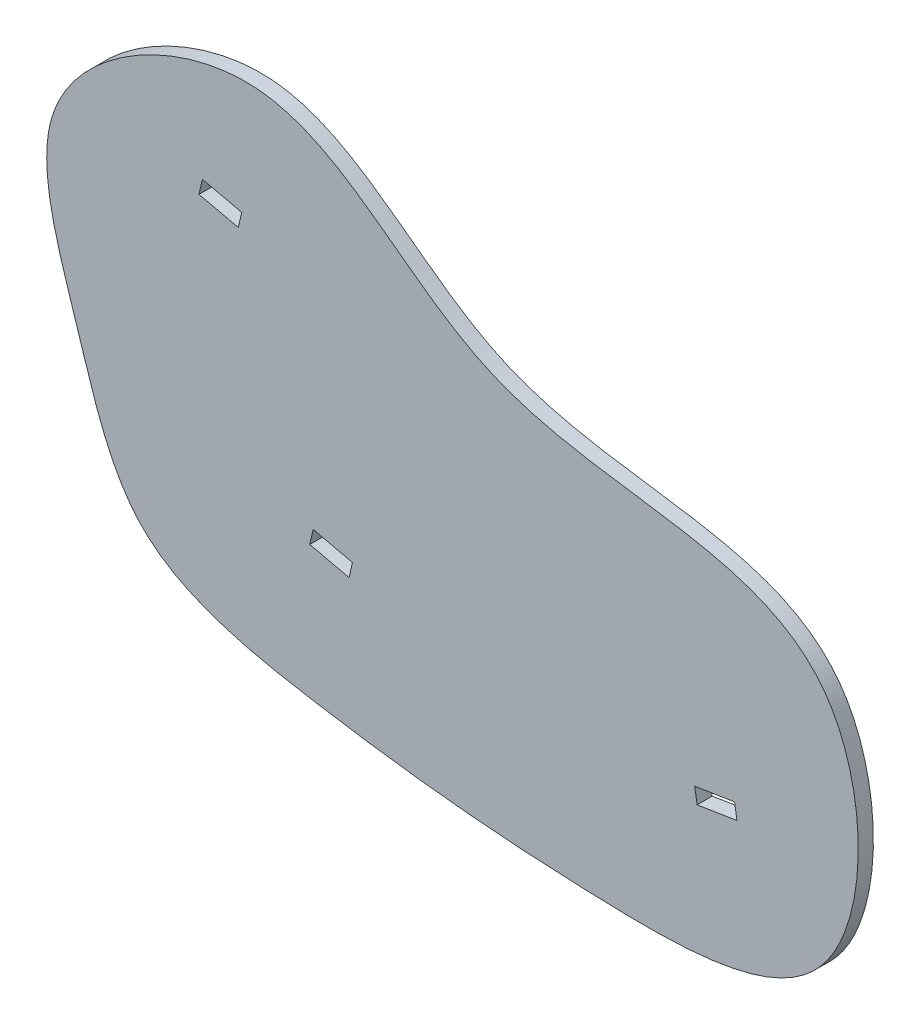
from build123d import *

# Parameters (mm, degrees)
BOSS_EXTRU_1_DEPTH      = 3
ENL_V_MAT_EXTRU_1_DEPTH = 10


with BuildPart() as part:
    # Esquisse1 → Boss.-Extru.1 (new body)
    with BuildSketch(Plane.XY):
        with BuildLine():
            add(Edge.make_bspline(
                [(-18.864168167, 58.934577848), (-34.265243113, 59.970351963), (-68.728278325, 40.47988391), (-54.053292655, 1.331674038), (-44.653372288, -33.433048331), (1.658070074, -42.880903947), (42.297327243, -46.844151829), (102.968426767, -46.433520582), (102.740932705, 33.63067355), (26.461888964, 18.734725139), (-1.47242723, 57.764924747), (-18.864168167, 58.934577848)],
                knots=[0, 0, 0, 0, 0.110992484, 0.194396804, 0.268191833, 0.351801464, 0.49083549, 0.595467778, 0.706739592, 0.874661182, 1, 1, 1, 1], degree=3))
        make_face()
    extrude(amount=BOSS_EXTRU_1_DEPTH)

    # Esquisse3 → Enl_v. mat.-Extru.1 (cut)
    with BuildSketch(Plane.XY.offset(3)):
        Polygon((68.183160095, -17.459798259), (68.65246349, -20.422863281), (76.553970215, -19.17138756), (76.08466682, -16.208322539), align=None)
        Polygon((-0.354365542, -15.903430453), (0.314881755, -12.979031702), (-7.483514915, -11.194372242), (-8.152762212, -14.118770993), align=None)
        Polygon((-22.317722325, 33.234505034), (-21.648475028, 36.158903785), (-29.446871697, 37.943563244), (-30.116118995, 35.019164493), align=None)
    extrude(amount=-ENL_V_MAT_EXTRU_1_DEPTH, mode=Mode.SUBTRACT)


solid = part.part
